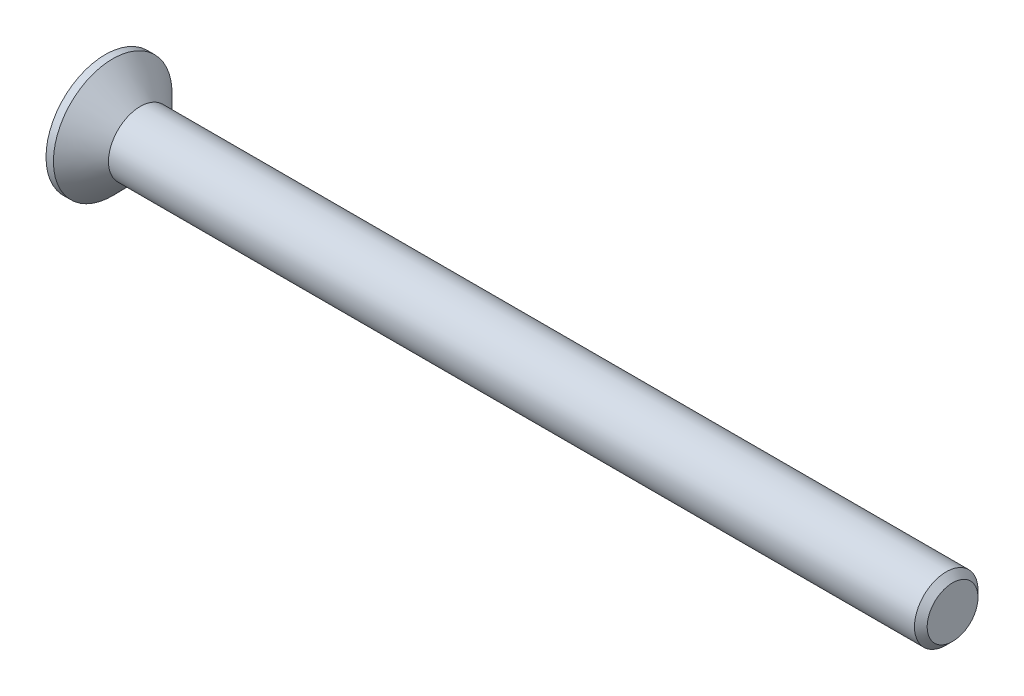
from build123d import *

# Parameters (mm, degrees)
CHAMFER1_SIZE      = 0.3
CUT_EXTRUDE1_DEPTH = 1.25


with BuildPart() as part:
    # Sketch1 → Revolve1 (revolve)
    with BuildSketch(Plane.XY, mode=Mode.PRIVATE) as revolve1_sk:
        Polygon((-1.65, 2.8), (-1.65, 0), (38.35, 0), (38.35, 1.5), (0, 1.5), (-1.3, 2.8), align=None)
    revolve(revolve1_sk.sketch.rotate(Axis((-1.65, 0, 0), (1, 0, 0)), 90), axis=Axis((-1.65, 0, 0), (1, 0, 0)))

    # Chamfer1
    chamfer1_edges = [part.edges().sort_by_distance(p)[0] for p in [
        (38.35, 0, -1.5),
    ]]
    chamfer(chamfer1_edges, length=CHAMFER1_SIZE)

    # Sketch2 → Cut-Extrude1 (cut)
    with BuildSketch(Plane.ZY.offset(1.65)):
        Polygon((-0.365, 1.45), (0.365, 1.45), (0.365, 0.365), (1.45, 0.365), (1.45, -0.365), (0.365, -0.365), (0.365, -1.45), (-0.365, -1.45), (-0.365, -0.365), (-1.45, -0.365), (-1.45, 0.365), (-0.365, 0.365), align=None)
    extrude(amount=-CUT_EXTRUDE1_DEPTH, mode=Mode.SUBTRACT)


solid = part.part
